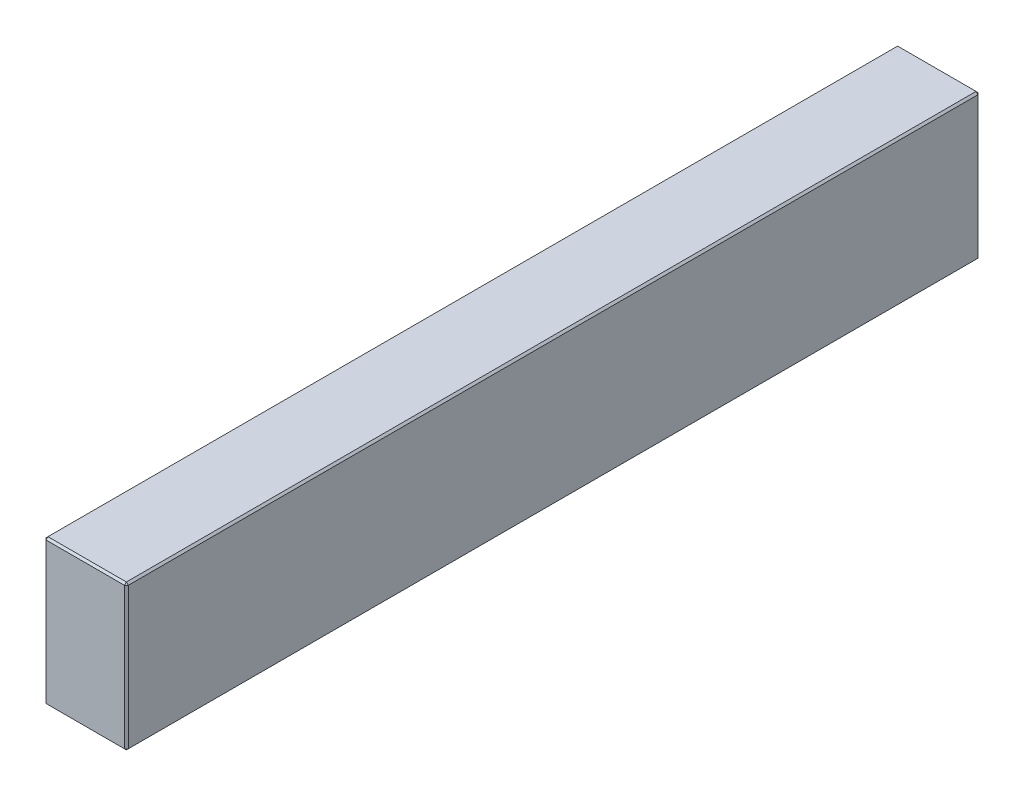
ISO-10303-21;
HEADER;
FILE_DESCRIPTION(('STEP AP214'),'2;1');
FILE_NAME('part.step','',(''),(''),'','','');
FILE_SCHEMA(('AUTOMOTIVE_DESIGN { 1 0 10303 214 1 1 1 1 }'));
ENDSEC;
DATA;
#1=APPLICATION_CONTEXT('core data for automotive mechanical design processes');
#2=APPLICATION_PROTOCOL_DEFINITION('international standard','automotive_design',2000,#1);
#3=PRODUCT_CONTEXT('',#1,'mechanical');
#4=PRODUCT('Part','Part','',(#3));
#5=PRODUCT_RELATED_PRODUCT_CATEGORY('part','',(#4));
#6=PRODUCT_DEFINITION_FORMATION('','',#4);
#7=PRODUCT_DEFINITION_CONTEXT('part definition',#1,'design');
#8=PRODUCT_DEFINITION('design','',#6,#7);
#9=PRODUCT_DEFINITION_SHAPE('','',#8);
#10=(LENGTH_UNIT() NAMED_UNIT(*) SI_UNIT(.MILLI.,.METRE.));
#11=(NAMED_UNIT(*) PLANE_ANGLE_UNIT() SI_UNIT($,.RADIAN.));
#12=(NAMED_UNIT(*) SI_UNIT($,.STERADIAN.) SOLID_ANGLE_UNIT());
#13=UNCERTAINTY_MEASURE_WITH_UNIT(LENGTH_MEASURE(1.E-05),#10,'distance_accuracy_value','');
#14=(GEOMETRIC_REPRESENTATION_CONTEXT(3) GLOBAL_UNCERTAINTY_ASSIGNED_CONTEXT((#13)) GLOBAL_UNIT_ASSIGNED_CONTEXT((#10,
#11,#12)) REPRESENTATION_CONTEXT('',''));
#15=CARTESIAN_POINT('',(0.,0.,0.));
#16=DIRECTION('',(0.,0.,1.));
#17=DIRECTION('',(1.,0.,0.));
#18=AXIS2_PLACEMENT_3D('',#15,#16,#17);
#19=CARTESIAN_POINT('',(-21.5,76.,223.));
#20=DIRECTION('',(1.,0.,0.));
#21=DIRECTION('',(0.,0.,-1.));
#22=AXIS2_PLACEMENT_3D('',#19,#20,#21);
#23=PLANE('',#22);
#24=DIRECTION('',(0.,-1.,0.));
#25=VECTOR('',#24,1.);
#26=CARTESIAN_POINT('',(-21.5,76.,-222.));
#27=LINE('',#26,#25);
#28=CARTESIAN_POINT('',(-21.5,75.,-222.));
#29=VERTEX_POINT('',#28);
#30=CARTESIAN_POINT('',(-21.5,1.00000000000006,-222.));
#31=VERTEX_POINT('',#30);
#32=EDGE_CURVE('E114',#29,#31,#27,.T.);
#33=ORIENTED_EDGE('',*,*,#32,.T.);
#34=DIRECTION('',(0.,0.,1.));
#35=VECTOR('',#34,1.);
#36=CARTESIAN_POINT('',(-21.5,1.00000000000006,223.));
#37=LINE('',#36,#35);
#38=CARTESIAN_POINT('',(-21.5,1.00000000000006,222.));
#39=VERTEX_POINT('',#38);
#40=EDGE_CURVE('E110',#31,#39,#37,.T.);
#41=ORIENTED_EDGE('',*,*,#40,.T.);
#42=DIRECTION('',(0.,1.,0.));
#43=VECTOR('',#42,1.);
#44=CARTESIAN_POINT('',(-21.5,76.,222.));
#45=LINE('',#44,#43);
#46=CARTESIAN_POINT('',(-21.5,75.,222.));
#47=VERTEX_POINT('',#46);
#48=EDGE_CURVE('E103',#39,#47,#45,.T.);
#49=ORIENTED_EDGE('',*,*,#48,.T.);
#50=DIRECTION('',(0.,0.,-1.));
#51=VECTOR('',#50,1.);
#52=CARTESIAN_POINT('',(-21.5,75.,-223.));
#53=LINE('',#52,#51);
#54=EDGE_CURVE('E107',#47,#29,#53,.T.);
#55=ORIENTED_EDGE('',*,*,#54,.T.);
#56=EDGE_LOOP('',(#33,#41,#49,#55));
#57=FACE_BOUND('',#56,.T.);
#58=ADVANCED_FACE('F15',(#57),#23,.F.);
#59=CARTESIAN_POINT('',(21.5,76.,223.));
#60=DIRECTION('',(0.,0.,-1.));
#61=DIRECTION('',(-1.,0.,0.));
#62=AXIS2_PLACEMENT_3D('',#59,#60,#61);
#63=PLANE('',#62);
#64=DIRECTION('',(-1.,0.,0.));
#65=VECTOR('',#64,1.);
#66=CARTESIAN_POINT('',(-21.5,75.,223.));
#67=LINE('',#66,#65);
#68=CARTESIAN_POINT('',(20.5,75.,223.));
#69=VERTEX_POINT('',#68);
#70=CARTESIAN_POINT('',(-20.5,75.,223.));
#71=VERTEX_POINT('',#70);
#72=EDGE_CURVE('E164',#69,#71,#67,.T.);
#73=ORIENTED_EDGE('',*,*,#72,.T.);
#74=DIRECTION('',(0.,-1.,0.));
#75=VECTOR('',#74,1.);
#76=CARTESIAN_POINT('',(-20.5,76.,223.));
#77=LINE('',#76,#75);
#78=CARTESIAN_POINT('',(-20.5,1.00000000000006,223.));
#79=VERTEX_POINT('',#78);
#80=EDGE_CURVE('E122',#71,#79,#77,.T.);
#81=ORIENTED_EDGE('',*,*,#80,.T.);
#82=DIRECTION('',(1.,0.,0.));
#83=VECTOR('',#82,1.);
#84=CARTESIAN_POINT('',(21.5,1.00000000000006,223.));
#85=LINE('',#84,#83);
#86=CARTESIAN_POINT('',(20.5,1.00000000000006,223.));
#87=VERTEX_POINT('',#86);
#88=EDGE_CURVE('E168',#79,#87,#85,.T.);
#89=ORIENTED_EDGE('',*,*,#88,.T.);
#90=DIRECTION('',(0.,1.,0.));
#91=VECTOR('',#90,1.);
#92=CARTESIAN_POINT('',(20.5,76.,223.));
#93=LINE('',#92,#91);
#94=EDGE_CURVE('E166',#87,#69,#93,.T.);
#95=ORIENTED_EDGE('',*,*,#94,.T.);
#96=EDGE_LOOP('',(#73,#81,#89,#95));
#97=FACE_BOUND('',#96,.T.);
#98=ADVANCED_FACE('F275',(#97),#63,.F.);
#99=CARTESIAN_POINT('',(21.5,76.,223.));
#100=DIRECTION('',(-1.,0.,0.));
#101=DIRECTION('',(0.,0.,1.));
#102=AXIS2_PLACEMENT_3D('',#99,#100,#101);
#103=PLANE('',#102);
#104=DIRECTION('',(0.,0.,-1.));
#105=VECTOR('',#104,1.);
#106=CARTESIAN_POINT('',(21.5,1.00000000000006,223.));
#107=LINE('',#106,#105);
#108=CARTESIAN_POINT('',(21.5,1.00000000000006,222.));
#109=VERTEX_POINT('',#108);
#110=CARTESIAN_POINT('',(21.5,1.00000000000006,-222.));
#111=VERTEX_POINT('',#110);
#112=EDGE_CURVE('E159',#109,#111,#107,.T.);
#113=ORIENTED_EDGE('',*,*,#112,.T.);
#114=DIRECTION('',(0.,1.,0.));
#115=VECTOR('',#114,1.);
#116=CARTESIAN_POINT('',(21.5,76.,-222.));
#117=LINE('',#116,#115);
#118=CARTESIAN_POINT('',(21.5,75.,-222.));
#119=VERTEX_POINT('',#118);
#120=EDGE_CURVE('E161',#111,#119,#117,.T.);
#121=ORIENTED_EDGE('',*,*,#120,.T.);
#122=DIRECTION('',(0.,0.,1.));
#123=VECTOR('',#122,1.);
#124=CARTESIAN_POINT('',(21.5,75.,223.));
#125=LINE('',#124,#123);
#126=CARTESIAN_POINT('',(21.5,75.,222.));
#127=VERTEX_POINT('',#126);
#128=EDGE_CURVE('E155',#119,#127,#125,.T.);
#129=ORIENTED_EDGE('',*,*,#128,.T.);
#130=DIRECTION('',(0.,-1.,0.));
#131=VECTOR('',#130,1.);
#132=CARTESIAN_POINT('',(21.5,76.,222.));
#133=LINE('',#132,#131);
#134=EDGE_CURVE('E157',#127,#109,#133,.T.);
#135=ORIENTED_EDGE('',*,*,#134,.T.);
#136=EDGE_LOOP('',(#113,#121,#129,#135));
#137=FACE_BOUND('',#136,.T.);
#138=ADVANCED_FACE('F254',(#137),#103,.F.);
#139=CARTESIAN_POINT('',(21.5,76.,-223.));
#140=DIRECTION('',(0.,0.,1.));
#141=DIRECTION('',(1.,0.,0.));
#142=AXIS2_PLACEMENT_3D('',#139,#140,#141);
#143=PLANE('',#142);
#144=DIRECTION('',(0.,-1.,0.));
#145=VECTOR('',#144,1.);
#146=CARTESIAN_POINT('',(20.5,76.,-223.));
#147=LINE('',#146,#145);
#148=CARTESIAN_POINT('',(20.5,75.,-223.));
#149=VERTEX_POINT('',#148);
#150=CARTESIAN_POINT('',(20.5,1.00000000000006,-223.));
#151=VERTEX_POINT('',#150);
#152=EDGE_CURVE('E148',#149,#151,#147,.T.);
#153=ORIENTED_EDGE('',*,*,#152,.T.);
#154=DIRECTION('',(-1.,0.,0.));
#155=VECTOR('',#154,1.);
#156=CARTESIAN_POINT('',(21.5,1.00000000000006,-223.));
#157=LINE('',#156,#155);
#158=CARTESIAN_POINT('',(-20.5,1.00000000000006,-223.));
#159=VERTEX_POINT('',#158);
#160=EDGE_CURVE('E153',#151,#159,#157,.T.);
#161=ORIENTED_EDGE('',*,*,#160,.T.);
#162=DIRECTION('',(0.,1.,0.));
#163=VECTOR('',#162,1.);
#164=CARTESIAN_POINT('',(-20.5,76.,-223.));
#165=LINE('',#164,#163);
#166=CARTESIAN_POINT('',(-20.5,75.,-223.));
#167=VERTEX_POINT('',#166);
#168=EDGE_CURVE('E150',#159,#167,#165,.T.);
#169=ORIENTED_EDGE('',*,*,#168,.T.);
#170=DIRECTION('',(1.,0.,0.));
#171=VECTOR('',#170,1.);
#172=CARTESIAN_POINT('',(21.5,75.,-223.));
#173=LINE('',#172,#171);
#174=EDGE_CURVE('E146',#167,#149,#173,.T.);
#175=ORIENTED_EDGE('',*,*,#174,.T.);
#176=EDGE_LOOP('',(#153,#161,#169,#175));
#177=FACE_BOUND('',#176,.T.);
#178=ADVANCED_FACE('F284',(#177),#143,.F.);
#179=CARTESIAN_POINT('',(0.,76.,0.));
#180=DIRECTION('',(0.,1.,0.));
#181=DIRECTION('',(0.,0.,1.));
#182=AXIS2_PLACEMENT_3D('',#179,#180,#181);
#183=PLANE('',#182);
#184=DIRECTION('',(0.,0.,-1.));
#185=VECTOR('',#184,1.);
#186=CARTESIAN_POINT('',(20.5,76.,-223.));
#187=LINE('',#186,#185);
#188=CARTESIAN_POINT('',(20.5,76.,222.));
#189=VERTEX_POINT('',#188);
#190=CARTESIAN_POINT('',(20.5,76.,-222.));
#191=VERTEX_POINT('',#190);
#192=EDGE_CURVE('E24',#189,#191,#187,.T.);
#193=ORIENTED_EDGE('',*,*,#192,.T.);
#194=DIRECTION('',(-1.,0.,0.));
#195=VECTOR('',#194,1.);
#196=CARTESIAN_POINT('',(-21.5,76.,-222.));
#197=LINE('',#196,#195);
#198=CARTESIAN_POINT('',(-20.5,76.,-222.));
#199=VERTEX_POINT('',#198);
#200=EDGE_CURVE('E9',#191,#199,#197,.T.);
#201=ORIENTED_EDGE('',*,*,#200,.T.);
#202=DIRECTION('',(0.,0.,1.));
#203=VECTOR('',#202,1.);
#204=CARTESIAN_POINT('',(-20.5,76.,223.));
#205=LINE('',#204,#203);
#206=CARTESIAN_POINT('',(-20.5,76.,222.));
#207=VERTEX_POINT('',#206);
#208=EDGE_CURVE('E180',#199,#207,#205,.T.);
#209=ORIENTED_EDGE('',*,*,#208,.T.);
#210=DIRECTION('',(1.,0.,0.));
#211=VECTOR('',#210,1.);
#212=CARTESIAN_POINT('',(21.5,76.,222.));
#213=LINE('',#212,#211);
#214=EDGE_CURVE('E35',#207,#189,#213,.T.);
#215=ORIENTED_EDGE('',*,*,#214,.T.);
#216=EDGE_LOOP('',(#193,#201,#209,#215));
#217=FACE_BOUND('',#216,.T.);
#218=ADVANCED_FACE('F350',(#217),#183,.T.);
#219=CARTESIAN_POINT('',(0.,0.,0.));
#220=DIRECTION('',(0.,1.,0.));
#221=DIRECTION('',(0.,0.,1.));
#222=AXIS2_PLACEMENT_3D('',#219,#220,#221);
#223=PLANE('',#222);
#224=DIRECTION('',(0.,0.,1.));
#225=VECTOR('',#224,1.);
#226=CARTESIAN_POINT('',(20.5,0.,0.));
#227=LINE('',#226,#225);
#228=CARTESIAN_POINT('',(20.5,0.,-222.));
#229=VERTEX_POINT('',#228);
#230=CARTESIAN_POINT('',(20.5,0.,222.));
#231=VERTEX_POINT('',#230);
#232=EDGE_CURVE('E171',#229,#231,#227,.T.);
#233=ORIENTED_EDGE('',*,*,#232,.T.);
#234=DIRECTION('',(-1.,0.,0.));
#235=VECTOR('',#234,1.);
#236=CARTESIAN_POINT('',(0.,0.,222.));
#237=LINE('',#236,#235);
#238=CARTESIAN_POINT('',(-20.5,0.,222.));
#239=VERTEX_POINT('',#238);
#240=EDGE_CURVE('E177',#231,#239,#237,.T.);
#241=ORIENTED_EDGE('',*,*,#240,.T.);
#242=DIRECTION('',(0.,0.,-1.));
#243=VECTOR('',#242,1.);
#244=CARTESIAN_POINT('',(-20.5,0.,0.));
#245=LINE('',#244,#243);
#246=CARTESIAN_POINT('',(-20.5,0.,-222.));
#247=VERTEX_POINT('',#246);
#248=EDGE_CURVE('E175',#239,#247,#245,.T.);
#249=ORIENTED_EDGE('',*,*,#248,.T.);
#250=DIRECTION('',(1.,0.,0.));
#251=VECTOR('',#250,1.);
#252=CARTESIAN_POINT('',(0.,0.,-222.));
#253=LINE('',#252,#251);
#254=EDGE_CURVE('E173',#247,#229,#253,.T.);
#255=ORIENTED_EDGE('',*,*,#254,.T.);
#256=EDGE_LOOP('',(#233,#241,#249,#255));
#257=FACE_BOUND('',#256,.T.);
#258=ADVANCED_FACE('F246',(#257),#223,.F.);
#259=CARTESIAN_POINT('',(21.5,76.,222.));
#260=DIRECTION('',(-0.707106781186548,0.,-0.707106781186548));
#261=DIRECTION('',(0.,-1.,0.));
#262=AXIS2_PLACEMENT_3D('',#259,#260,#261);
#263=PLANE('',#262);
#264=DIRECTION('',(-0.707106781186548,0.,0.707106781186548));
#265=VECTOR('',#264,1.);
#266=CARTESIAN_POINT('',(20.5,75.,223.));
#267=LINE('',#266,#265);
#268=EDGE_CURVE('E19',#69,#127,#267,.F.);
#269=ORIENTED_EDGE('',*,*,#268,.F.);
#270=ORIENTED_EDGE('',*,*,#94,.F.);
#271=DIRECTION('',(0.707106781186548,0.,-0.707106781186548));
#272=VECTOR('',#271,1.);
#273=CARTESIAN_POINT('',(20.5,1.00000000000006,223.));
#274=LINE('',#273,#272);
#275=EDGE_CURVE('E142',#109,#87,#274,.F.);
#276=ORIENTED_EDGE('',*,*,#275,.F.);
#277=ORIENTED_EDGE('',*,*,#134,.F.);
#278=EDGE_LOOP('',(#269,#270,#276,#277));
#279=FACE_BOUND('',#278,.T.);
#280=ADVANCED_FACE('F17',(#279),#263,.F.);
#281=CARTESIAN_POINT('',(20.5,75.,223.));
#282=DIRECTION('',(0.577350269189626,0.577350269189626,0.577350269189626));
#283=DIRECTION('',(0.707106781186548,0.,-0.707106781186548));
#284=AXIS2_PLACEMENT_3D('',#281,#282,#283);
#285=PLANE('',#284);
#286=DIRECTION('',(0.,-0.707106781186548,0.707106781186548));
#287=VECTOR('',#286,1.);
#288=CARTESIAN_POINT('',(20.5,75.,223.));
#289=LINE('',#288,#287);
#290=EDGE_CURVE('E226',#69,#189,#289,.F.);
#291=ORIENTED_EDGE('',*,*,#290,.F.);
#292=ORIENTED_EDGE('',*,*,#268,.T.);
#293=DIRECTION('',(-0.707106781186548,0.707106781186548,0.));
#294=VECTOR('',#293,1.);
#295=CARTESIAN_POINT('',(21.,75.5,222.));
#296=LINE('',#295,#294);
#297=EDGE_CURVE('E228',#189,#127,#296,.F.);
#298=ORIENTED_EDGE('',*,*,#297,.F.);
#299=EDGE_LOOP('',(#291,#292,#298));
#300=FACE_BOUND('',#299,.T.);
#301=ADVANCED_FACE('F270',(#300),#285,.T.);
#302=CARTESIAN_POINT('',(20.5,1.00000000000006,223.));
#303=DIRECTION('',(0.577350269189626,-0.577350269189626,0.577350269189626));
#304=DIRECTION('',(0.707106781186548,0.,-0.707106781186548));
#305=AXIS2_PLACEMENT_3D('',#302,#303,#304);
#306=PLANE('',#305);
#307=DIRECTION('',(-0.707106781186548,-0.707106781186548,0.));
#308=VECTOR('',#307,1.);
#309=CARTESIAN_POINT('',(21.,0.500000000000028,222.));
#310=LINE('',#309,#308);
#311=EDGE_CURVE('E220',#109,#231,#310,.T.);
#312=ORIENTED_EDGE('',*,*,#311,.F.);
#313=ORIENTED_EDGE('',*,*,#275,.T.);
#314=DIRECTION('',(0.,0.707106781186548,0.707106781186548));
#315=VECTOR('',#314,1.);
#316=CARTESIAN_POINT('',(20.5,1.00000000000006,223.));
#317=LINE('',#316,#315);
#318=EDGE_CURVE('E223',#231,#87,#317,.T.);
#319=ORIENTED_EDGE('',*,*,#318,.F.);
#320=EDGE_LOOP('',(#312,#313,#319));
#321=FACE_BOUND('',#320,.T.);
#322=ADVANCED_FACE('F235',(#321),#306,.T.);
#323=CARTESIAN_POINT('',(20.5,76.,0.));
#324=DIRECTION('',(0.707106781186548,0.707106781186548,0.));
#325=DIRECTION('',(0.,0.,1.));
#326=AXIS2_PLACEMENT_3D('',#323,#324,#325);
#327=PLANE('',#326);
#328=ORIENTED_EDGE('',*,*,#297,.T.);
#329=ORIENTED_EDGE('',*,*,#128,.F.);
#330=DIRECTION('',(0.707106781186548,-0.707106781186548,0.));
#331=VECTOR('',#330,1.);
#332=CARTESIAN_POINT('',(21.5,75.,-222.));
#333=LINE('',#332,#331);
#334=EDGE_CURVE('E215',#191,#119,#333,.T.);
#335=ORIENTED_EDGE('',*,*,#334,.F.);
#336=ORIENTED_EDGE('',*,*,#192,.F.);
#337=EDGE_LOOP('',(#328,#329,#335,#336));
#338=FACE_BOUND('',#337,.T.);
#339=ADVANCED_FACE('F265',(#338),#327,.T.);
#340=CARTESIAN_POINT('',(0.,76.,222.));
#341=DIRECTION('',(0.,0.707106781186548,0.707106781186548));
#342=DIRECTION('',(-1.,0.,0.));
#343=AXIS2_PLACEMENT_3D('',#340,#341,#342);
#344=PLANE('',#343);
#345=ORIENTED_EDGE('',*,*,#290,.T.);
#346=ORIENTED_EDGE('',*,*,#214,.F.);
#347=DIRECTION('',(0.,0.707106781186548,-0.707106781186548));
#348=VECTOR('',#347,1.);
#349=CARTESIAN_POINT('',(-20.5,75.5,222.5));
#350=LINE('',#349,#348);
#351=EDGE_CURVE('E126',#71,#207,#350,.T.);
#352=ORIENTED_EDGE('',*,*,#351,.F.);
#353=ORIENTED_EDGE('',*,*,#72,.F.);
#354=EDGE_LOOP('',(#345,#346,#352,#353));
#355=FACE_BOUND('',#354,.T.);
#356=ADVANCED_FACE('F273',(#355),#344,.T.);
#357=CARTESIAN_POINT('',(-20.5,76.,223.));
#358=DIRECTION('',(0.707106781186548,0.,-0.707106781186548));
#359=DIRECTION('',(0.,-1.,0.));
#360=AXIS2_PLACEMENT_3D('',#357,#358,#359);
#361=PLANE('',#360);
#362=DIRECTION('',(0.707106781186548,0.,0.707106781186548));
#363=VECTOR('',#362,1.);
#364=CARTESIAN_POINT('',(-20.5,1.00000000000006,223.));
#365=LINE('',#364,#363);
#366=EDGE_CURVE('E127',#79,#39,#365,.F.);
#367=ORIENTED_EDGE('',*,*,#366,.F.);
#368=ORIENTED_EDGE('',*,*,#80,.F.);
#369=DIRECTION('',(-0.707106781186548,0.,-0.707106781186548));
#370=VECTOR('',#369,1.);
#371=CARTESIAN_POINT('',(-21.5,75.,222.));
#372=LINE('',#371,#370);
#373=EDGE_CURVE('E118',#47,#71,#372,.F.);
#374=ORIENTED_EDGE('',*,*,#373,.F.);
#375=ORIENTED_EDGE('',*,*,#48,.F.);
#376=EDGE_LOOP('',(#367,#368,#374,#375));
#377=FACE_BOUND('',#376,.T.);
#378=ADVANCED_FACE('F120',(#377),#361,.F.);
#379=CARTESIAN_POINT('',(21.5,1.00000000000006,223.));
#380=DIRECTION('',(0.,0.707106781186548,-0.707106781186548));
#381=DIRECTION('',(1.,0.,0.));
#382=AXIS2_PLACEMENT_3D('',#379,#380,#381);
#383=PLANE('',#382);
#384=ORIENTED_EDGE('',*,*,#318,.T.);
#385=ORIENTED_EDGE('',*,*,#88,.F.);
#386=DIRECTION('',(0.,-0.707106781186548,-0.707106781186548));
#387=VECTOR('',#386,1.);
#388=CARTESIAN_POINT('',(-20.5,1.00000000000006,223.));
#389=LINE('',#388,#387);
#390=EDGE_CURVE('E211',#239,#79,#389,.F.);
#391=ORIENTED_EDGE('',*,*,#390,.F.);
#392=ORIENTED_EDGE('',*,*,#240,.F.);
#393=EDGE_LOOP('',(#384,#385,#391,#392));
#394=FACE_BOUND('',#393,.T.);
#395=ADVANCED_FACE('F243',(#394),#383,.F.);
#396=CARTESIAN_POINT('',(21.5,1.00000000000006,223.));
#397=DIRECTION('',(-0.707106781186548,0.707106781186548,0.));
#398=DIRECTION('',(0.,0.,-1.));
#399=AXIS2_PLACEMENT_3D('',#396,#397,#398);
#400=PLANE('',#399);
#401=ORIENTED_EDGE('',*,*,#311,.T.);
#402=ORIENTED_EDGE('',*,*,#232,.F.);
#403=DIRECTION('',(0.707106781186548,0.707106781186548,0.));
#404=VECTOR('',#403,1.);
#405=CARTESIAN_POINT('',(21.,0.500000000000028,-222.));
#406=LINE('',#405,#404);
#407=EDGE_CURVE('E208',#111,#229,#406,.F.);
#408=ORIENTED_EDGE('',*,*,#407,.F.);
#409=ORIENTED_EDGE('',*,*,#112,.F.);
#410=EDGE_LOOP('',(#401,#402,#408,#409));
#411=FACE_BOUND('',#410,.T.);
#412=ADVANCED_FACE('F251',(#411),#400,.F.);
#413=CARTESIAN_POINT('',(20.5,76.,-223.));
#414=DIRECTION('',(-0.707106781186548,0.,0.707106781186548));
#415=DIRECTION('',(0.,-1.,0.));
#416=AXIS2_PLACEMENT_3D('',#413,#414,#415);
#417=PLANE('',#416);
#418=DIRECTION('',(0.707106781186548,0.,0.707106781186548));
#419=VECTOR('',#418,1.);
#420=CARTESIAN_POINT('',(21.5,75.,-222.));
#421=LINE('',#420,#419);
#422=EDGE_CURVE('E217',#119,#149,#421,.F.);
#423=ORIENTED_EDGE('',*,*,#422,.F.);
#424=ORIENTED_EDGE('',*,*,#120,.F.);
#425=DIRECTION('',(-0.707106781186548,0.,-0.707106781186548));
#426=VECTOR('',#425,1.);
#427=CARTESIAN_POINT('',(20.5,1.00000000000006,-223.));
#428=LINE('',#427,#426);
#429=EDGE_CURVE('E205',#151,#111,#428,.F.);
#430=ORIENTED_EDGE('',*,*,#429,.F.);
#431=ORIENTED_EDGE('',*,*,#152,.F.);
#432=EDGE_LOOP('',(#423,#424,#430,#431));
#433=FACE_BOUND('',#432,.T.);
#434=ADVANCED_FACE('F258',(#433),#417,.F.);
#435=CARTESIAN_POINT('',(21.5,75.,-222.));
#436=DIRECTION('',(0.577350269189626,0.577350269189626,-0.577350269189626));
#437=DIRECTION('',(-0.707106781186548,0.,-0.707106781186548));
#438=AXIS2_PLACEMENT_3D('',#435,#436,#437);
#439=PLANE('',#438);
#440=ORIENTED_EDGE('',*,*,#334,.T.);
#441=ORIENTED_EDGE('',*,*,#422,.T.);
#442=DIRECTION('',(0.,0.707106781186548,0.707106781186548));
#443=VECTOR('',#442,1.);
#444=CARTESIAN_POINT('',(20.5,75.5,-222.5));
#445=LINE('',#444,#443);
#446=EDGE_CURVE('E134',#191,#149,#445,.F.);
#447=ORIENTED_EDGE('',*,*,#446,.F.);
#448=EDGE_LOOP('',(#440,#441,#447));
#449=FACE_BOUND('',#448,.T.);
#450=ADVANCED_FACE('F325',(#449),#439,.T.);
#451=CARTESIAN_POINT('',(-21.5,75.,222.));
#452=DIRECTION('',(-0.577350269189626,0.577350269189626,0.577350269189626));
#453=DIRECTION('',(0.707106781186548,0.,0.707106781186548));
#454=AXIS2_PLACEMENT_3D('',#451,#452,#453);
#455=PLANE('',#454);
#456=ORIENTED_EDGE('',*,*,#373,.T.);
#457=ORIENTED_EDGE('',*,*,#351,.T.);
#458=DIRECTION('',(-0.707106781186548,-0.707106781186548,0.));
#459=VECTOR('',#458,1.);
#460=CARTESIAN_POINT('',(-21.5,75.,222.));
#461=LINE('',#460,#459);
#462=EDGE_CURVE('E130',#47,#207,#461,.F.);
#463=ORIENTED_EDGE('',*,*,#462,.F.);
#464=EDGE_LOOP('',(#456,#457,#463));
#465=FACE_BOUND('',#464,.T.);
#466=ADVANCED_FACE('F131',(#465),#455,.T.);
#467=CARTESIAN_POINT('',(-20.5,1.00000000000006,223.));
#468=DIRECTION('',(-0.577350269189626,-0.577350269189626,0.577350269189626));
#469=DIRECTION('',(0.707106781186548,0.,0.707106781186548));
#470=AXIS2_PLACEMENT_3D('',#467,#468,#469);
#471=PLANE('',#470);
#472=ORIENTED_EDGE('',*,*,#390,.T.);
#473=ORIENTED_EDGE('',*,*,#366,.T.);
#474=DIRECTION('',(-0.707106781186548,0.707106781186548,0.));
#475=VECTOR('',#474,1.);
#476=CARTESIAN_POINT('',(-21.,0.500000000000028,222.));
#477=LINE('',#476,#475);
#478=EDGE_CURVE('E135',#239,#39,#477,.T.);
#479=ORIENTED_EDGE('',*,*,#478,.F.);
#480=EDGE_LOOP('',(#472,#473,#479));
#481=FACE_BOUND('',#480,.T.);
#482=ADVANCED_FACE('F318',(#481),#471,.T.);
#483=CARTESIAN_POINT('',(20.5,1.00000000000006,-223.));
#484=DIRECTION('',(0.577350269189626,-0.577350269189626,-0.577350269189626));
#485=DIRECTION('',(-0.707106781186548,0.,-0.707106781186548));
#486=AXIS2_PLACEMENT_3D('',#483,#484,#485);
#487=PLANE('',#486);
#488=ORIENTED_EDGE('',*,*,#429,.T.);
#489=ORIENTED_EDGE('',*,*,#407,.T.);
#490=DIRECTION('',(0.,-0.707106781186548,0.707106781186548));
#491=VECTOR('',#490,1.);
#492=CARTESIAN_POINT('',(20.5,1.00000000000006,-223.));
#493=LINE('',#492,#491);
#494=EDGE_CURVE('E198',#151,#229,#493,.T.);
#495=ORIENTED_EDGE('',*,*,#494,.F.);
#496=EDGE_LOOP('',(#488,#489,#495));
#497=FACE_BOUND('',#496,.T.);
#498=ADVANCED_FACE('F314',(#497),#487,.T.);
#499=CARTESIAN_POINT('',(0.,76.,-222.));
#500=DIRECTION('',(0.,0.707106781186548,-0.707106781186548));
#501=DIRECTION('',(1.,0.,0.));
#502=AXIS2_PLACEMENT_3D('',#499,#500,#501);
#503=PLANE('',#502);
#504=ORIENTED_EDGE('',*,*,#446,.T.);
#505=ORIENTED_EDGE('',*,*,#174,.F.);
#506=DIRECTION('',(0.,-0.707106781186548,-0.707106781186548));
#507=VECTOR('',#506,1.);
#508=CARTESIAN_POINT('',(-20.5,75.,-223.));
#509=LINE('',#508,#507);
#510=EDGE_CURVE('E195',#199,#167,#509,.T.);
#511=ORIENTED_EDGE('',*,*,#510,.F.);
#512=ORIENTED_EDGE('',*,*,#200,.F.);
#513=EDGE_LOOP('',(#504,#505,#511,#512));
#514=FACE_BOUND('',#513,.T.);
#515=ADVANCED_FACE('F311',(#514),#503,.T.);
#516=CARTESIAN_POINT('',(-20.5,76.,0.));
#517=DIRECTION('',(-0.707106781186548,0.707106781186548,0.));
#518=DIRECTION('',(0.,0.,-1.));
#519=AXIS2_PLACEMENT_3D('',#516,#517,#518);
#520=PLANE('',#519);
#521=ORIENTED_EDGE('',*,*,#462,.T.);
#522=ORIENTED_EDGE('',*,*,#208,.F.);
#523=DIRECTION('',(0.707106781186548,0.707106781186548,0.));
#524=VECTOR('',#523,1.);
#525=CARTESIAN_POINT('',(-21.,75.5,-222.));
#526=LINE('',#525,#524);
#527=EDGE_CURVE('E138',#29,#199,#526,.T.);
#528=ORIENTED_EDGE('',*,*,#527,.F.);
#529=ORIENTED_EDGE('',*,*,#54,.F.);
#530=EDGE_LOOP('',(#521,#522,#528,#529));
#531=FACE_BOUND('',#530,.T.);
#532=ADVANCED_FACE('F137',(#531),#520,.T.);
#533=CARTESIAN_POINT('',(-21.5,1.00000000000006,223.));
#534=DIRECTION('',(0.707106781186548,0.707106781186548,0.));
#535=DIRECTION('',(0.,0.,1.));
#536=AXIS2_PLACEMENT_3D('',#533,#534,#535);
#537=PLANE('',#536);
#538=ORIENTED_EDGE('',*,*,#478,.T.);
#539=ORIENTED_EDGE('',*,*,#40,.F.);
#540=DIRECTION('',(0.707106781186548,-0.707106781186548,0.));
#541=VECTOR('',#540,1.);
#542=CARTESIAN_POINT('',(-21.5,1.00000000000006,-222.));
#543=LINE('',#542,#541);
#544=EDGE_CURVE('E191',#247,#31,#543,.F.);
#545=ORIENTED_EDGE('',*,*,#544,.F.);
#546=ORIENTED_EDGE('',*,*,#248,.F.);
#547=EDGE_LOOP('',(#538,#539,#545,#546));
#548=FACE_BOUND('',#547,.T.);
#549=ADVANCED_FACE('F304',(#548),#537,.F.);
#550=CARTESIAN_POINT('',(21.5,1.00000000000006,-223.));
#551=DIRECTION('',(0.,0.707106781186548,0.707106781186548));
#552=DIRECTION('',(-1.,0.,0.));
#553=AXIS2_PLACEMENT_3D('',#550,#551,#552);
#554=PLANE('',#553);
#555=ORIENTED_EDGE('',*,*,#494,.T.);
#556=ORIENTED_EDGE('',*,*,#254,.F.);
#557=DIRECTION('',(0.,0.707106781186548,-0.707106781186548));
#558=VECTOR('',#557,1.);
#559=CARTESIAN_POINT('',(-20.5,0.500000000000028,-222.5));
#560=LINE('',#559,#558);
#561=EDGE_CURVE('E188',#159,#247,#560,.F.);
#562=ORIENTED_EDGE('',*,*,#561,.F.);
#563=ORIENTED_EDGE('',*,*,#160,.F.);
#564=EDGE_LOOP('',(#555,#556,#562,#563));
#565=FACE_BOUND('',#564,.T.);
#566=ADVANCED_FACE('F300',(#565),#554,.F.);
#567=CARTESIAN_POINT('',(-20.5,75.,-223.));
#568=DIRECTION('',(-0.577350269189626,0.577350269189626,-0.577350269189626));
#569=DIRECTION('',(-0.707106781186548,0.,0.707106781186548));
#570=AXIS2_PLACEMENT_3D('',#567,#568,#569);
#571=PLANE('',#570);
#572=ORIENTED_EDGE('',*,*,#527,.T.);
#573=ORIENTED_EDGE('',*,*,#510,.T.);
#574=DIRECTION('',(0.707106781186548,0.,-0.707106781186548));
#575=VECTOR('',#574,1.);
#576=CARTESIAN_POINT('',(-20.5,75.,-223.));
#577=LINE('',#576,#575);
#578=EDGE_CURVE('E186',#29,#167,#577,.T.);
#579=ORIENTED_EDGE('',*,*,#578,.F.);
#580=EDGE_LOOP('',(#572,#573,#579));
#581=FACE_BOUND('',#580,.T.);
#582=ADVANCED_FACE('F296',(#581),#571,.T.);
#583=CARTESIAN_POINT('',(-21.5,1.00000000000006,-222.));
#584=DIRECTION('',(-0.577350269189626,-0.577350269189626,-0.577350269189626));
#585=DIRECTION('',(-0.707106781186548,0.,0.707106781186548));
#586=AXIS2_PLACEMENT_3D('',#583,#584,#585);
#587=PLANE('',#586);
#588=ORIENTED_EDGE('',*,*,#561,.T.);
#589=ORIENTED_EDGE('',*,*,#544,.T.);
#590=DIRECTION('',(-0.707106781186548,0.,0.707106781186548));
#591=VECTOR('',#590,1.);
#592=CARTESIAN_POINT('',(-21.5,1.00000000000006,-222.));
#593=LINE('',#592,#591);
#594=EDGE_CURVE('E184',#159,#31,#593,.T.);
#595=ORIENTED_EDGE('',*,*,#594,.F.);
#596=EDGE_LOOP('',(#588,#589,#595));
#597=FACE_BOUND('',#596,.T.);
#598=ADVANCED_FACE('F292',(#597),#587,.T.);
#599=CARTESIAN_POINT('',(-21.5,76.,-222.));
#600=DIRECTION('',(0.707106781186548,0.,0.707106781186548));
#601=DIRECTION('',(0.,-1.,0.));
#602=AXIS2_PLACEMENT_3D('',#599,#600,#601);
#603=PLANE('',#602);
#604=ORIENTED_EDGE('',*,*,#578,.T.);
#605=ORIENTED_EDGE('',*,*,#168,.F.);
#606=ORIENTED_EDGE('',*,*,#594,.T.);
#607=ORIENTED_EDGE('',*,*,#32,.F.);
#608=EDGE_LOOP('',(#604,#605,#606,#607));
#609=FACE_BOUND('',#608,.T.);
#610=ADVANCED_FACE('F289',(#609),#603,.F.);
#611=CLOSED_SHELL('',(#58,#98,#138,#178,#218,#258,#280,#301,#322,#339,#356,#378,#395,#412,#434,
#450,#466,#482,#498,#515,#532,#549,#566,#582,#598,#610));
#612=MANIFOLD_SOLID_BREP('B1',#611);
#613=ADVANCED_BREP_SHAPE_REPRESENTATION('',(#18,#612),#14);
#614=SHAPE_DEFINITION_REPRESENTATION(#9,#613);
ENDSEC;
END-ISO-10303-21;
